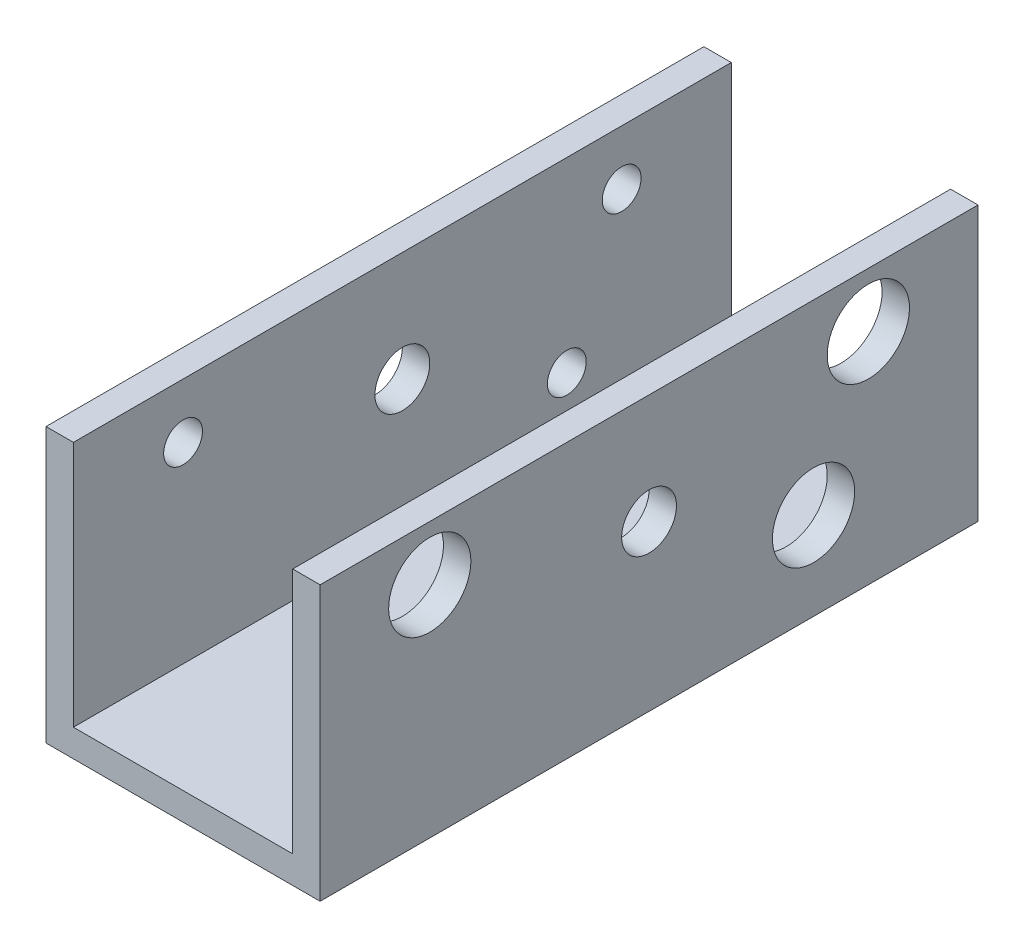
ISO-10303-21;
HEADER;
FILE_DESCRIPTION(('STEP AP214'),'2;1');
FILE_NAME('part.step','',(''),(''),'','','');
FILE_SCHEMA(('AUTOMOTIVE_DESIGN { 1 0 10303 214 1 1 1 1 }'));
ENDSEC;
DATA;
#1=APPLICATION_CONTEXT('core data for automotive mechanical design processes');
#2=APPLICATION_PROTOCOL_DEFINITION('international standard','automotive_design',2000,#1);
#3=PRODUCT_CONTEXT('',#1,'mechanical');
#4=PRODUCT('Part','Part','',(#3));
#5=PRODUCT_RELATED_PRODUCT_CATEGORY('part','',(#4));
#6=PRODUCT_DEFINITION_FORMATION('','',#4);
#7=PRODUCT_DEFINITION_CONTEXT('part definition',#1,'design');
#8=PRODUCT_DEFINITION('design','',#6,#7);
#9=PRODUCT_DEFINITION_SHAPE('','',#8);
#10=(LENGTH_UNIT() NAMED_UNIT(*) SI_UNIT(.MILLI.,.METRE.));
#11=(NAMED_UNIT(*) PLANE_ANGLE_UNIT() SI_UNIT($,.RADIAN.));
#12=(NAMED_UNIT(*) SI_UNIT($,.STERADIAN.) SOLID_ANGLE_UNIT());
#13=UNCERTAINTY_MEASURE_WITH_UNIT(LENGTH_MEASURE(1.E-05),#10,'distance_accuracy_value','');
#14=(GEOMETRIC_REPRESENTATION_CONTEXT(3) GLOBAL_UNCERTAINTY_ASSIGNED_CONTEXT((#13)) GLOBAL_UNIT_ASSIGNED_CONTEXT((#10,
#11,#12)) REPRESENTATION_CONTEXT('',''));
#15=CARTESIAN_POINT('',(0.,0.,0.));
#16=DIRECTION('',(0.,0.,1.));
#17=DIRECTION('',(1.,0.,0.));
#18=AXIS2_PLACEMENT_3D('',#15,#16,#17);
#19=CARTESIAN_POINT('',(31.75,0.,76.2));
#20=DIRECTION('',(0.,1.,0.));
#21=DIRECTION('',(-1.,0.,0.));
#22=AXIS2_PLACEMENT_3D('',#19,#20,#21);
#23=PLANE('',#22);
#24=DIRECTION('',(1.,0.,0.));
#25=VECTOR('',#24,1.);
#26=CARTESIAN_POINT('',(31.75,0.,0.));
#27=LINE('',#26,#25);
#28=CARTESIAN_POINT('',(0.,0.,0.));
#29=VERTEX_POINT('',#28);
#30=CARTESIAN_POINT('',(31.75,0.,0.));
#31=VERTEX_POINT('',#30);
#32=EDGE_CURVE('E129',#29,#31,#27,.T.);
#33=ORIENTED_EDGE('',*,*,#32,.T.);
#34=DIRECTION('',(0.,0.,-1.));
#35=VECTOR('',#34,1.);
#36=CARTESIAN_POINT('',(31.75,0.,76.2));
#37=LINE('',#36,#35);
#38=CARTESIAN_POINT('',(31.75,0.,76.2));
#39=VERTEX_POINT('',#38);
#40=EDGE_CURVE('E11',#39,#31,#37,.T.);
#41=ORIENTED_EDGE('',*,*,#40,.F.);
#42=DIRECTION('',(1.,0.,0.));
#43=VECTOR('',#42,1.);
#44=CARTESIAN_POINT('',(31.75,0.,76.2));
#45=LINE('',#44,#43);
#46=CARTESIAN_POINT('',(0.,0.,76.2));
#47=VERTEX_POINT('',#46);
#48=EDGE_CURVE('E144',#47,#39,#45,.T.);
#49=ORIENTED_EDGE('',*,*,#48,.F.);
#50=DIRECTION('',(0.,0.,-1.));
#51=VECTOR('',#50,1.);
#52=CARTESIAN_POINT('',(0.,0.,76.2));
#53=LINE('',#52,#51);
#54=EDGE_CURVE('E125',#47,#29,#53,.T.);
#55=ORIENTED_EDGE('',*,*,#54,.T.);
#56=EDGE_LOOP('',(#33,#41,#49,#55));
#57=FACE_BOUND('',#56,.T.);
#58=ADVANCED_FACE('F32',(#57),#23,.F.);
#59=CARTESIAN_POINT('',(31.75,31.75,76.2));
#60=DIRECTION('',(-1.,0.,0.));
#61=DIRECTION('',(0.,-1.,0.));
#62=AXIS2_PLACEMENT_3D('',#59,#60,#61);
#63=PLANE('',#62);
#64=CARTESIAN_POINT('',(31.75,10.16,19.05));
#65=DIRECTION('',(1.,0.,0.));
#66=DIRECTION('',(0.,1.,0.));
#67=AXIS2_PLACEMENT_3D('',#64,#65,#66);
#68=CIRCLE('',#67,4.7625);
#69=CARTESIAN_POINT('',(31.75,14.9225,19.05));
#70=VERTEX_POINT('',#69);
#71=EDGE_CURVE('E196',#70,#70,#68,.T.);
#72=ORIENTED_EDGE('',*,*,#71,.F.);
#73=EDGE_LOOP('',(#72));
#74=FACE_BOUND('',#73,.T.);
#75=CARTESIAN_POINT('',(31.75,25.4,12.7));
#76=DIRECTION('',(1.,0.,0.));
#77=DIRECTION('',(0.,1.,0.));
#78=AXIS2_PLACEMENT_3D('',#75,#76,#77);
#79=CIRCLE('',#78,4.7625);
#80=CARTESIAN_POINT('',(31.75,30.1625,12.7));
#81=VERTEX_POINT('',#80);
#82=EDGE_CURVE('E190',#81,#81,#79,.T.);
#83=ORIENTED_EDGE('',*,*,#82,.F.);
#84=EDGE_LOOP('',(#83));
#85=FACE_BOUND('',#84,.T.);
#86=CARTESIAN_POINT('',(31.75,25.4,63.5));
#87=DIRECTION('',(1.,0.,0.));
#88=DIRECTION('',(0.,1.,0.));
#89=AXIS2_PLACEMENT_3D('',#86,#87,#88);
#90=CIRCLE('',#89,4.7625);
#91=CARTESIAN_POINT('',(31.75,30.1625,63.5));
#92=VERTEX_POINT('',#91);
#93=EDGE_CURVE('E184',#92,#92,#90,.T.);
#94=ORIENTED_EDGE('',*,*,#93,.F.);
#95=EDGE_LOOP('',(#94));
#96=FACE_BOUND('',#95,.T.);
#97=CARTESIAN_POINT('',(31.75,19.05,38.1));
#98=DIRECTION('',(1.,0.,0.));
#99=DIRECTION('',(0.,1.,0.));
#100=AXIS2_PLACEMENT_3D('',#97,#98,#99);
#101=CIRCLE('',#100,3.175);
#102=CARTESIAN_POINT('',(31.75,22.225,38.1));
#103=VERTEX_POINT('',#102);
#104=EDGE_CURVE('E178',#103,#103,#101,.T.);
#105=ORIENTED_EDGE('',*,*,#104,.F.);
#106=EDGE_LOOP('',(#105));
#107=FACE_BOUND('',#106,.T.);
#108=DIRECTION('',(0.,1.,0.));
#109=VECTOR('',#108,1.);
#110=CARTESIAN_POINT('',(31.75,31.75,0.));
#111=LINE('',#110,#109);
#112=CARTESIAN_POINT('',(31.75,31.75,0.));
#113=VERTEX_POINT('',#112);
#114=EDGE_CURVE('E132',#31,#113,#111,.T.);
#115=ORIENTED_EDGE('',*,*,#114,.T.);
#116=DIRECTION('',(0.,0.,-1.));
#117=VECTOR('',#116,1.);
#118=CARTESIAN_POINT('',(31.75,31.75,76.2));
#119=LINE('',#118,#117);
#120=CARTESIAN_POINT('',(31.75,31.75,76.2));
#121=VERTEX_POINT('',#120);
#122=EDGE_CURVE('E41',#121,#113,#119,.T.);
#123=ORIENTED_EDGE('',*,*,#122,.F.);
#124=DIRECTION('',(0.,1.,0.));
#125=VECTOR('',#124,1.);
#126=CARTESIAN_POINT('',(31.75,31.75,76.2));
#127=LINE('',#126,#125);
#128=EDGE_CURVE('E92',#39,#121,#127,.T.);
#129=ORIENTED_EDGE('',*,*,#128,.F.);
#130=ORIENTED_EDGE('',*,*,#40,.T.);
#131=EDGE_LOOP('',(#115,#123,#129,#130));
#132=FACE_BOUND('',#131,.T.);
#133=ADVANCED_FACE('F253',(#74,#85,#96,#107,#132),#63,.F.);
#134=CARTESIAN_POINT('',(28.575,31.75,76.2));
#135=DIRECTION('',(0.,-1.,0.));
#136=DIRECTION('',(0.,0.,-1.));
#137=AXIS2_PLACEMENT_3D('',#134,#135,#136);
#138=PLANE('',#137);
#139=DIRECTION('',(-1.,0.,0.));
#140=VECTOR('',#139,1.);
#141=CARTESIAN_POINT('',(28.575,31.75,0.));
#142=LINE('',#141,#140);
#143=CARTESIAN_POINT('',(28.575,31.75,0.));
#144=VERTEX_POINT('',#143);
#145=EDGE_CURVE('E135',#113,#144,#142,.T.);
#146=ORIENTED_EDGE('',*,*,#145,.T.);
#147=DIRECTION('',(0.,0.,-1.));
#148=VECTOR('',#147,1.);
#149=CARTESIAN_POINT('',(28.575,31.75,76.2));
#150=LINE('',#149,#148);
#151=CARTESIAN_POINT('',(28.575,31.75,76.2));
#152=VERTEX_POINT('',#151);
#153=EDGE_CURVE('E151',#152,#144,#150,.T.);
#154=ORIENTED_EDGE('',*,*,#153,.F.);
#155=DIRECTION('',(-1.,0.,0.));
#156=VECTOR('',#155,1.);
#157=CARTESIAN_POINT('',(28.575,31.75,76.2));
#158=LINE('',#157,#156);
#159=EDGE_CURVE('E160',#121,#152,#158,.T.);
#160=ORIENTED_EDGE('',*,*,#159,.F.);
#161=ORIENTED_EDGE('',*,*,#122,.T.);
#162=EDGE_LOOP('',(#146,#154,#160,#161));
#163=FACE_BOUND('',#162,.T.);
#164=ADVANCED_FACE('F158',(#163),#138,.F.);
#165=CARTESIAN_POINT('',(28.575,3.175,76.2));
#166=DIRECTION('',(1.,0.,0.));
#167=DIRECTION('',(0.,0.,-1.));
#168=AXIS2_PLACEMENT_3D('',#165,#166,#167);
#169=PLANE('',#168);
#170=CARTESIAN_POINT('',(28.575,10.16,19.05));
#171=DIRECTION('',(1.,0.,0.));
#172=DIRECTION('',(0.,0.,-1.));
#173=AXIS2_PLACEMENT_3D('',#170,#171,#172);
#174=CIRCLE('',#173,4.7625);
#175=CARTESIAN_POINT('',(28.575,10.16,14.2875));
#176=VERTEX_POINT('',#175);
#177=EDGE_CURVE('E193',#176,#176,#174,.F.);
#178=ORIENTED_EDGE('',*,*,#177,.F.);
#179=EDGE_LOOP('',(#178));
#180=FACE_BOUND('',#179,.T.);
#181=CARTESIAN_POINT('',(28.575,25.4,12.7));
#182=DIRECTION('',(1.,0.,0.));
#183=DIRECTION('',(0.,0.,-1.));
#184=AXIS2_PLACEMENT_3D('',#181,#182,#183);
#185=CIRCLE('',#184,4.7625);
#186=CARTESIAN_POINT('',(28.575,25.4,7.9375));
#187=VERTEX_POINT('',#186);
#188=EDGE_CURVE('E187',#187,#187,#185,.F.);
#189=ORIENTED_EDGE('',*,*,#188,.F.);
#190=EDGE_LOOP('',(#189));
#191=FACE_BOUND('',#190,.T.);
#192=CARTESIAN_POINT('',(28.575,25.4,63.5));
#193=DIRECTION('',(1.,0.,0.));
#194=DIRECTION('',(0.,0.,-1.));
#195=AXIS2_PLACEMENT_3D('',#192,#193,#194);
#196=CIRCLE('',#195,4.7625);
#197=CARTESIAN_POINT('',(28.575,25.4,58.7375));
#198=VERTEX_POINT('',#197);
#199=EDGE_CURVE('E181',#198,#198,#196,.F.);
#200=ORIENTED_EDGE('',*,*,#199,.F.);
#201=EDGE_LOOP('',(#200));
#202=FACE_BOUND('',#201,.T.);
#203=CARTESIAN_POINT('',(28.575,19.05,38.1));
#204=DIRECTION('',(1.,0.,0.));
#205=DIRECTION('',(0.,0.,-1.));
#206=AXIS2_PLACEMENT_3D('',#203,#204,#205);
#207=CIRCLE('',#206,3.175);
#208=CARTESIAN_POINT('',(28.575,19.05,34.925));
#209=VERTEX_POINT('',#208);
#210=EDGE_CURVE('E133',#209,#209,#207,.F.);
#211=ORIENTED_EDGE('',*,*,#210,.F.);
#212=EDGE_LOOP('',(#211));
#213=FACE_BOUND('',#212,.T.);
#214=DIRECTION('',(0.,-1.,0.));
#215=VECTOR('',#214,1.);
#216=CARTESIAN_POINT('',(28.575,3.175,0.));
#217=LINE('',#216,#215);
#218=CARTESIAN_POINT('',(28.575,3.175,0.));
#219=VERTEX_POINT('',#218);
#220=EDGE_CURVE('E137',#144,#219,#217,.T.);
#221=ORIENTED_EDGE('',*,*,#220,.T.);
#222=DIRECTION('',(0.,0.,-1.));
#223=VECTOR('',#222,1.);
#224=CARTESIAN_POINT('',(28.575,3.175,76.2));
#225=LINE('',#224,#223);
#226=CARTESIAN_POINT('',(28.575,3.175,76.2));
#227=VERTEX_POINT('',#226);
#228=EDGE_CURVE('E148',#227,#219,#225,.T.);
#229=ORIENTED_EDGE('',*,*,#228,.F.);
#230=DIRECTION('',(0.,-1.,0.));
#231=VECTOR('',#230,1.);
#232=CARTESIAN_POINT('',(28.575,3.175,76.2));
#233=LINE('',#232,#231);
#234=EDGE_CURVE('E172',#152,#227,#233,.T.);
#235=ORIENTED_EDGE('',*,*,#234,.F.);
#236=ORIENTED_EDGE('',*,*,#153,.T.);
#237=EDGE_LOOP('',(#221,#229,#235,#236));
#238=FACE_BOUND('',#237,.T.);
#239=ADVANCED_FACE('F168',(#180,#191,#202,#213,#238),#169,.F.);
#240=CARTESIAN_POINT('',(3.175,3.17499999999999,76.2));
#241=DIRECTION('',(0.,-1.,0.));
#242=DIRECTION('',(1.,0.,0.));
#243=AXIS2_PLACEMENT_3D('',#240,#241,#242);
#244=PLANE('',#243);
#245=DIRECTION('',(-1.,0.,0.));
#246=VECTOR('',#245,1.);
#247=CARTESIAN_POINT('',(3.175,3.17499999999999,0.));
#248=LINE('',#247,#246);
#249=CARTESIAN_POINT('',(3.175,3.17499999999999,0.));
#250=VERTEX_POINT('',#249);
#251=EDGE_CURVE('E139',#219,#250,#248,.T.);
#252=ORIENTED_EDGE('',*,*,#251,.T.);
#253=DIRECTION('',(0.,0.,-1.));
#254=VECTOR('',#253,1.);
#255=CARTESIAN_POINT('',(3.175,3.17499999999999,76.2));
#256=LINE('',#255,#254);
#257=CARTESIAN_POINT('',(3.175,3.17499999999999,76.2));
#258=VERTEX_POINT('',#257);
#259=EDGE_CURVE('E120',#258,#250,#256,.T.);
#260=ORIENTED_EDGE('',*,*,#259,.F.);
#261=DIRECTION('',(-1.,0.,0.));
#262=VECTOR('',#261,1.);
#263=CARTESIAN_POINT('',(3.175,3.17499999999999,76.2));
#264=LINE('',#263,#262);
#265=EDGE_CURVE('E111',#227,#258,#264,.T.);
#266=ORIENTED_EDGE('',*,*,#265,.F.);
#267=ORIENTED_EDGE('',*,*,#228,.T.);
#268=EDGE_LOOP('',(#252,#260,#266,#267));
#269=FACE_BOUND('',#268,.T.);
#270=ADVANCED_FACE('F171',(#269),#244,.F.);
#271=CARTESIAN_POINT('',(3.175,31.75,76.2));
#272=DIRECTION('',(-1.,0.,0.));
#273=DIRECTION('',(0.,-1.,0.));
#274=AXIS2_PLACEMENT_3D('',#271,#272,#273);
#275=PLANE('',#274);
#276=CARTESIAN_POINT('',(3.175,25.4,12.7));
#277=DIRECTION('',(1.,0.,0.));
#278=DIRECTION('',(0.,0.,-1.));
#279=AXIS2_PLACEMENT_3D('',#276,#277,#278);
#280=CIRCLE('',#279,2.2479);
#281=CARTESIAN_POINT('',(3.175,25.4,10.4521));
#282=VERTEX_POINT('',#281);
#283=EDGE_CURVE('E219',#282,#282,#280,.T.);
#284=ORIENTED_EDGE('',*,*,#283,.F.);
#285=EDGE_LOOP('',(#284));
#286=FACE_BOUND('',#285,.T.);
#287=CARTESIAN_POINT('',(3.175,10.16,19.05));
#288=DIRECTION('',(1.,0.,0.));
#289=DIRECTION('',(0.,0.,-1.));
#290=AXIS2_PLACEMENT_3D('',#287,#288,#289);
#291=CIRCLE('',#290,2.2479);
#292=CARTESIAN_POINT('',(3.175,10.16,16.8021));
#293=VERTEX_POINT('',#292);
#294=EDGE_CURVE('E213',#293,#293,#291,.T.);
#295=ORIENTED_EDGE('',*,*,#294,.F.);
#296=EDGE_LOOP('',(#295));
#297=FACE_BOUND('',#296,.T.);
#298=CARTESIAN_POINT('',(3.175,25.4,63.5));
#299=DIRECTION('',(1.,0.,0.));
#300=DIRECTION('',(0.,0.,-1.));
#301=AXIS2_PLACEMENT_3D('',#298,#299,#300);
#302=CIRCLE('',#301,2.2479);
#303=CARTESIAN_POINT('',(3.175,25.4,61.2521));
#304=VERTEX_POINT('',#303);
#305=EDGE_CURVE('E210',#304,#304,#302,.T.);
#306=ORIENTED_EDGE('',*,*,#305,.F.);
#307=EDGE_LOOP('',(#306));
#308=FACE_BOUND('',#307,.T.);
#309=CARTESIAN_POINT('',(3.175,19.05,38.1));
#310=DIRECTION('',(1.,0.,0.));
#311=DIRECTION('',(0.,1.,0.));
#312=AXIS2_PLACEMENT_3D('',#309,#310,#311);
#313=CIRCLE('',#312,3.175);
#314=CARTESIAN_POINT('',(3.175,22.225,38.1));
#315=VERTEX_POINT('',#314);
#316=EDGE_CURVE('E202',#315,#315,#313,.T.);
#317=ORIENTED_EDGE('',*,*,#316,.F.);
#318=EDGE_LOOP('',(#317));
#319=FACE_BOUND('',#318,.T.);
#320=DIRECTION('',(0.,1.,0.));
#321=VECTOR('',#320,1.);
#322=CARTESIAN_POINT('',(3.175,31.75,0.));
#323=LINE('',#322,#321);
#324=CARTESIAN_POINT('',(3.175,31.75,0.));
#325=VERTEX_POINT('',#324);
#326=EDGE_CURVE('E119',#250,#325,#323,.T.);
#327=ORIENTED_EDGE('',*,*,#326,.T.);
#328=DIRECTION('',(0.,0.,-1.));
#329=VECTOR('',#328,1.);
#330=CARTESIAN_POINT('',(3.175,31.75,76.2));
#331=LINE('',#330,#329);
#332=CARTESIAN_POINT('',(3.175,31.75,76.2));
#333=VERTEX_POINT('',#332);
#334=EDGE_CURVE('E116',#333,#325,#331,.T.);
#335=ORIENTED_EDGE('',*,*,#334,.F.);
#336=DIRECTION('',(0.,1.,0.));
#337=VECTOR('',#336,1.);
#338=CARTESIAN_POINT('',(3.175,31.75,76.2));
#339=LINE('',#338,#337);
#340=EDGE_CURVE('E105',#258,#333,#339,.T.);
#341=ORIENTED_EDGE('',*,*,#340,.F.);
#342=ORIENTED_EDGE('',*,*,#259,.T.);
#343=EDGE_LOOP('',(#327,#335,#341,#342));
#344=FACE_BOUND('',#343,.T.);
#345=ADVANCED_FACE('F117',(#286,#297,#308,#319,#344),#275,.F.);
#346=CARTESIAN_POINT('',(0.,31.75,76.2));
#347=DIRECTION('',(0.,-1.,0.));
#348=DIRECTION('',(0.,0.,-1.));
#349=AXIS2_PLACEMENT_3D('',#346,#347,#348);
#350=PLANE('',#349);
#351=DIRECTION('',(-1.,0.,0.));
#352=VECTOR('',#351,1.);
#353=CARTESIAN_POINT('',(0.,31.75,0.));
#354=LINE('',#353,#352);
#355=CARTESIAN_POINT('',(0.,31.75,0.));
#356=VERTEX_POINT('',#355);
#357=EDGE_CURVE('E78',#325,#356,#354,.T.);
#358=ORIENTED_EDGE('',*,*,#357,.T.);
#359=DIRECTION('',(0.,0.,-1.));
#360=VECTOR('',#359,1.);
#361=CARTESIAN_POINT('',(0.,31.75,76.2));
#362=LINE('',#361,#360);
#363=CARTESIAN_POINT('',(0.,31.75,76.2));
#364=VERTEX_POINT('',#363);
#365=EDGE_CURVE('E121',#364,#356,#362,.T.);
#366=ORIENTED_EDGE('',*,*,#365,.F.);
#367=DIRECTION('',(-1.,0.,0.));
#368=VECTOR('',#367,1.);
#369=CARTESIAN_POINT('',(0.,31.75,76.2));
#370=LINE('',#369,#368);
#371=EDGE_CURVE('E109',#333,#364,#370,.T.);
#372=ORIENTED_EDGE('',*,*,#371,.F.);
#373=ORIENTED_EDGE('',*,*,#334,.T.);
#374=EDGE_LOOP('',(#358,#366,#372,#373));
#375=FACE_BOUND('',#374,.T.);
#376=ADVANCED_FACE('F123',(#375),#350,.F.);
#377=CARTESIAN_POINT('',(0.,0.,76.2));
#378=DIRECTION('',(1.,0.,0.));
#379=DIRECTION('',(0.,0.,-1.));
#380=AXIS2_PLACEMENT_3D('',#377,#378,#379);
#381=PLANE('',#380);
#382=CARTESIAN_POINT('',(0.,25.4,12.7));
#383=DIRECTION('',(1.,0.,0.));
#384=DIRECTION('',(0.,0.,-1.));
#385=AXIS2_PLACEMENT_3D('',#382,#383,#384);
#386=CIRCLE('',#385,2.24789999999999);
#387=CARTESIAN_POINT('',(0.,25.4,10.4521));
#388=VERTEX_POINT('',#387);
#389=EDGE_CURVE('E216',#388,#388,#386,.T.);
#390=ORIENTED_EDGE('',*,*,#389,.T.);
#391=EDGE_LOOP('',(#390));
#392=FACE_BOUND('',#391,.T.);
#393=CARTESIAN_POINT('',(0.,10.16,19.05));
#394=DIRECTION('',(1.,0.,0.));
#395=DIRECTION('',(0.,0.,-1.));
#396=AXIS2_PLACEMENT_3D('',#393,#394,#395);
#397=CIRCLE('',#396,2.24789999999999);
#398=CARTESIAN_POINT('',(0.,10.16,16.8021));
#399=VERTEX_POINT('',#398);
#400=EDGE_CURVE('E35',#399,#399,#397,.T.);
#401=ORIENTED_EDGE('',*,*,#400,.T.);
#402=EDGE_LOOP('',(#401));
#403=FACE_BOUND('',#402,.T.);
#404=CARTESIAN_POINT('',(0.,25.4,63.5));
#405=DIRECTION('',(1.,0.,0.));
#406=DIRECTION('',(0.,0.,-1.));
#407=AXIS2_PLACEMENT_3D('',#404,#405,#406);
#408=CIRCLE('',#407,2.24789999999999);
#409=CARTESIAN_POINT('',(0.,25.4,61.2521));
#410=VERTEX_POINT('',#409);
#411=EDGE_CURVE('E205',#410,#410,#408,.T.);
#412=ORIENTED_EDGE('',*,*,#411,.T.);
#413=EDGE_LOOP('',(#412));
#414=FACE_BOUND('',#413,.T.);
#415=CARTESIAN_POINT('',(0.,19.05,38.1));
#416=DIRECTION('',(1.,0.,0.));
#417=DIRECTION('',(0.,1.,0.));
#418=AXIS2_PLACEMENT_3D('',#415,#416,#417);
#419=CIRCLE('',#418,3.175);
#420=CARTESIAN_POINT('',(0.,22.225,38.1));
#421=VERTEX_POINT('',#420);
#422=EDGE_CURVE('E199',#421,#421,#419,.T.);
#423=ORIENTED_EDGE('',*,*,#422,.T.);
#424=EDGE_LOOP('',(#423));
#425=FACE_BOUND('',#424,.T.);
#426=DIRECTION('',(0.,-1.,0.));
#427=VECTOR('',#426,1.);
#428=CARTESIAN_POINT('',(0.,0.,0.));
#429=LINE('',#428,#427);
#430=EDGE_CURVE('E84',#356,#29,#429,.T.);
#431=ORIENTED_EDGE('',*,*,#430,.T.);
#432=ORIENTED_EDGE('',*,*,#54,.F.);
#433=DIRECTION('',(0.,-1.,0.));
#434=VECTOR('',#433,1.);
#435=CARTESIAN_POINT('',(0.,0.,76.2));
#436=LINE('',#435,#434);
#437=EDGE_CURVE('E49',#364,#47,#436,.T.);
#438=ORIENTED_EDGE('',*,*,#437,.F.);
#439=ORIENTED_EDGE('',*,*,#365,.T.);
#440=EDGE_LOOP('',(#431,#432,#438,#439));
#441=FACE_BOUND('',#440,.T.);
#442=ADVANCED_FACE('F261',(#392,#403,#414,#425,#441),#381,.F.);
#443=CARTESIAN_POINT('',(0.,0.,76.2));
#444=DIRECTION('',(0.,0.,-1.));
#445=DIRECTION('',(-1.,0.,0.));
#446=AXIS2_PLACEMENT_3D('',#443,#444,#445);
#447=PLANE('',#446);
#448=ORIENTED_EDGE('',*,*,#48,.T.);
#449=ORIENTED_EDGE('',*,*,#128,.T.);
#450=ORIENTED_EDGE('',*,*,#159,.T.);
#451=ORIENTED_EDGE('',*,*,#234,.T.);
#452=ORIENTED_EDGE('',*,*,#265,.T.);
#453=ORIENTED_EDGE('',*,*,#340,.T.);
#454=ORIENTED_EDGE('',*,*,#371,.T.);
#455=ORIENTED_EDGE('',*,*,#437,.T.);
#456=EDGE_LOOP('',(#448,#449,#450,#451,#452,#453,#454,#455));
#457=FACE_BOUND('',#456,.T.);
#458=ADVANCED_FACE('F107',(#457),#447,.F.);
#459=CARTESIAN_POINT('',(0.,0.,0.));
#460=DIRECTION('',(0.,0.,-1.));
#461=DIRECTION('',(-1.,0.,0.));
#462=AXIS2_PLACEMENT_3D('',#459,#460,#461);
#463=PLANE('',#462);
#464=ORIENTED_EDGE('',*,*,#32,.F.);
#465=ORIENTED_EDGE('',*,*,#430,.F.);
#466=ORIENTED_EDGE('',*,*,#357,.F.);
#467=ORIENTED_EDGE('',*,*,#326,.F.);
#468=ORIENTED_EDGE('',*,*,#251,.F.);
#469=ORIENTED_EDGE('',*,*,#220,.F.);
#470=ORIENTED_EDGE('',*,*,#145,.F.);
#471=ORIENTED_EDGE('',*,*,#114,.F.);
#472=EDGE_LOOP('',(#464,#465,#466,#467,#468,#469,#470,#471));
#473=FACE_BOUND('',#472,.T.);
#474=ADVANCED_FACE('F164',(#473),#463,.T.);
#475=CARTESIAN_POINT('',(-0.00100000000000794,19.05,38.1));
#476=DIRECTION('',(1.,0.,0.));
#477=DIRECTION('',(0.,1.,0.));
#478=AXIS2_PLACEMENT_3D('',#475,#476,#477);
#479=CYLINDRICAL_SURFACE('',#478,3.175);
#480=ORIENTED_EDGE('',*,*,#104,.T.);
#481=EDGE_LOOP('',(#480));
#482=FACE_BOUND('',#481,.T.);
#483=ORIENTED_EDGE('',*,*,#210,.T.);
#484=EDGE_LOOP('',(#483));
#485=FACE_BOUND('',#484,.T.);
#486=ADVANCED_FACE('F316',(#482,#485),#479,.F.);
#487=CARTESIAN_POINT('',(-0.00100000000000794,25.4,63.5));
#488=DIRECTION('',(1.,0.,0.));
#489=DIRECTION('',(0.,1.,0.));
#490=AXIS2_PLACEMENT_3D('',#487,#488,#489);
#491=CYLINDRICAL_SURFACE('',#490,4.7625);
#492=ORIENTED_EDGE('',*,*,#93,.T.);
#493=EDGE_LOOP('',(#492));
#494=FACE_BOUND('',#493,.T.);
#495=ORIENTED_EDGE('',*,*,#199,.T.);
#496=EDGE_LOOP('',(#495));
#497=FACE_BOUND('',#496,.T.);
#498=ADVANCED_FACE('F340',(#494,#497),#491,.F.);
#499=CARTESIAN_POINT('',(-0.00100000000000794,25.4,12.7));
#500=DIRECTION('',(1.,0.,0.));
#501=DIRECTION('',(0.,1.,0.));
#502=AXIS2_PLACEMENT_3D('',#499,#500,#501);
#503=CYLINDRICAL_SURFACE('',#502,4.7625);
#504=ORIENTED_EDGE('',*,*,#82,.T.);
#505=EDGE_LOOP('',(#504));
#506=FACE_BOUND('',#505,.T.);
#507=ORIENTED_EDGE('',*,*,#188,.T.);
#508=EDGE_LOOP('',(#507));
#509=FACE_BOUND('',#508,.T.);
#510=ADVANCED_FACE('F248',(#506,#509),#503,.F.);
#511=CARTESIAN_POINT('',(-0.001000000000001,10.16,19.05));
#512=DIRECTION('',(1.,0.,0.));
#513=DIRECTION('',(0.,1.,0.));
#514=AXIS2_PLACEMENT_3D('',#511,#512,#513);
#515=CYLINDRICAL_SURFACE('',#514,4.7625);
#516=ORIENTED_EDGE('',*,*,#71,.T.);
#517=EDGE_LOOP('',(#516));
#518=FACE_BOUND('',#517,.T.);
#519=ORIENTED_EDGE('',*,*,#177,.T.);
#520=EDGE_LOOP('',(#519));
#521=FACE_BOUND('',#520,.T.);
#522=ADVANCED_FACE('F238',(#518,#521),#515,.F.);
#523=CARTESIAN_POINT('',(0.,19.05,38.1));
#524=DIRECTION('',(1.,0.,0.));
#525=DIRECTION('',(0.,1.,0.));
#526=AXIS2_PLACEMENT_3D('',#523,#524,#525);
#527=CYLINDRICAL_SURFACE('',#526,3.175);
#528=CARTESIAN_POINT('',(0.,22.225,38.1));
#529=CARTESIAN_POINT('',(0.0330729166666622,22.225,38.1));
#530=CARTESIAN_POINT('',(0.0661458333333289,22.225,38.1));
#531=CARTESIAN_POINT('',(0.132291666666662,22.225,38.1));
#532=CARTESIAN_POINT('',(0.165364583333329,22.225,38.1));
#533=CARTESIAN_POINT('',(0.231510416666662,22.225,38.1));
#534=CARTESIAN_POINT('',(0.264583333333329,22.225,38.1));
#535=CARTESIAN_POINT('',(0.330729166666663,22.225,38.1));
#536=CARTESIAN_POINT('',(0.363802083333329,22.225,38.1));
#537=CARTESIAN_POINT('',(0.429947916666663,22.225,38.1));
#538=CARTESIAN_POINT('',(0.463020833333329,22.225,38.1));
#539=CARTESIAN_POINT('',(0.529166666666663,22.225,38.1));
#540=CARTESIAN_POINT('',(0.56223958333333,22.225,38.1));
#541=CARTESIAN_POINT('',(0.628385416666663,22.225,38.1));
#542=CARTESIAN_POINT('',(0.66145833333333,22.225,38.1));
#543=CARTESIAN_POINT('',(0.727604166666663,22.225,38.1));
#544=CARTESIAN_POINT('',(0.76067708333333,22.225,38.1));
#545=CARTESIAN_POINT('',(0.826822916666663,22.225,38.1));
#546=CARTESIAN_POINT('',(0.85989583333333,22.225,38.1));
#547=CARTESIAN_POINT('',(0.926041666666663,22.225,38.1));
#548=CARTESIAN_POINT('',(0.95911458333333,22.225,38.1));
#549=CARTESIAN_POINT('',(1.02526041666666,22.225,38.1));
#550=CARTESIAN_POINT('',(1.05833333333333,22.225,38.1));
#551=CARTESIAN_POINT('',(1.12447916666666,22.225,38.1));
#552=CARTESIAN_POINT('',(1.15755208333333,22.225,38.1));
#553=CARTESIAN_POINT('',(1.22369791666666,22.225,38.1));
#554=CARTESIAN_POINT('',(1.25677083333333,22.225,38.1));
#555=CARTESIAN_POINT('',(1.32291666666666,22.225,38.1));
#556=CARTESIAN_POINT('',(1.35598958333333,22.225,38.1));
#557=CARTESIAN_POINT('',(1.42213541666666,22.225,38.1));
#558=CARTESIAN_POINT('',(1.45520833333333,22.225,38.1));
#559=CARTESIAN_POINT('',(1.52135416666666,22.225,38.1));
#560=CARTESIAN_POINT('',(1.55442708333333,22.225,38.1));
#561=CARTESIAN_POINT('',(1.62057291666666,22.225,38.1));
#562=CARTESIAN_POINT('',(1.65364583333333,22.225,38.1));
#563=CARTESIAN_POINT('',(1.71979166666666,22.225,38.1));
#564=CARTESIAN_POINT('',(1.75286458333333,22.225,38.1));
#565=CARTESIAN_POINT('',(1.81901041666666,22.225,38.1));
#566=CARTESIAN_POINT('',(1.85208333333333,22.225,38.1));
#567=CARTESIAN_POINT('',(1.91822916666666,22.225,38.1));
#568=CARTESIAN_POINT('',(1.95130208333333,22.225,38.1));
#569=CARTESIAN_POINT('',(2.01744791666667,22.225,38.1));
#570=CARTESIAN_POINT('',(2.05052083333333,22.225,38.1));
#571=CARTESIAN_POINT('',(2.11666666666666,22.225,38.1));
#572=CARTESIAN_POINT('',(2.14973958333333,22.225,38.1));
#573=CARTESIAN_POINT('',(2.21588541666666,22.225,38.1));
#574=CARTESIAN_POINT('',(2.24895833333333,22.225,38.1));
#575=CARTESIAN_POINT('',(2.31510416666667,22.225,38.1));
#576=CARTESIAN_POINT('',(2.34817708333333,22.225,38.1));
#577=CARTESIAN_POINT('',(2.41432291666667,22.225,38.1));
#578=CARTESIAN_POINT('',(2.44739583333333,22.225,38.1));
#579=CARTESIAN_POINT('',(2.51354166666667,22.225,38.1));
#580=CARTESIAN_POINT('',(2.54661458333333,22.225,38.1));
#581=CARTESIAN_POINT('',(2.61276041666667,22.225,38.1));
#582=CARTESIAN_POINT('',(2.64583333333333,22.225,38.1));
#583=CARTESIAN_POINT('',(2.71197916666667,22.225,38.1));
#584=CARTESIAN_POINT('',(2.74505208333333,22.225,38.1));
#585=CARTESIAN_POINT('',(2.81119791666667,22.225,38.1));
#586=CARTESIAN_POINT('',(2.84427083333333,22.225,38.1));
#587=CARTESIAN_POINT('',(2.91041666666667,22.225,38.1));
#588=CARTESIAN_POINT('',(2.94348958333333,22.225,38.1));
#589=CARTESIAN_POINT('',(3.00963541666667,22.225,38.1));
#590=CARTESIAN_POINT('',(3.04270833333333,22.225,38.1));
#591=CARTESIAN_POINT('',(3.10885416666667,22.225,38.1));
#592=CARTESIAN_POINT('',(3.14192708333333,22.225,38.1));
#593=CARTESIAN_POINT('',(3.175,22.225,38.1));
#594=B_SPLINE_CURVE_WITH_KNOTS('',3,(#528,#529,#530,#531,#532,#533,#534,#535,#536,#537,#538,
#539,#540,#541,#542,#543,#544,#545,#546,#547,#548,#549,#550,#551,#552,#553,#554,#555,#556,#557,
#558,#559,#560,#561,#562,#563,#564,#565,#566,#567,#568,#569,#570,#571,#572,#573,#574,#575,#576,
#577,#578,#579,#580,#581,#582,#583,#584,#585,#586,#587,#588,#589,#590,#591,#592,#593),
.UNSPECIFIED.,.F.,.F.,(4,2,2,2,2,2,2,2,2,2,2,2,2,2,2,2,2,2,2,2,2,2,2,2,2,2,2,2,2,2,2,2,4),(0.,
0.0992187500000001,0.1984375,0.297656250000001,0.396875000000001,0.496093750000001,
0.595312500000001,0.694531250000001,0.793750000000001,0.892968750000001,0.992187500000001,
1.09140625,1.190625,1.28984375,1.3890625,1.48828125,1.5875,1.68671875,1.7859375,1.88515625,
1.984375,2.08359375,2.1828125,2.28203125,2.38125,2.48046875,2.5796875,2.67890625,2.778125,
2.87734375,2.9765625,3.07578125,3.175),.UNSPECIFIED.);
#595=EDGE_CURVE('BSEAM235',#421,#315,#594,.T.);
#596=ORIENTED_EDGE('',*,*,#422,.F.);
#597=ORIENTED_EDGE('',*,*,#316,.T.);
#598=ORIENTED_EDGE('',*,*,#595,.T.);
#599=ORIENTED_EDGE('',*,*,#595,.F.);
#600=EDGE_LOOP('',(#596,#598,#597,#599));
#601=FACE_BOUND('',#600,.T.);
#602=ADVANCED_FACE('F235',(#601),#527,.F.);
#603=CARTESIAN_POINT('',(3.175,25.4,63.5));
#604=DIRECTION('',(1.,0.,0.));
#605=DIRECTION('',(0.,0.,-1.));
#606=AXIS2_PLACEMENT_3D('',#603,#604,#605);
#607=CYLINDRICAL_SURFACE('',#606,2.24789999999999);
#608=ORIENTED_EDGE('',*,*,#305,.T.);
#609=EDGE_LOOP('',(#608));
#610=FACE_BOUND('',#609,.T.);
#611=ORIENTED_EDGE('',*,*,#411,.F.);
#612=EDGE_LOOP('',(#611));
#613=FACE_BOUND('',#612,.T.);
#614=ADVANCED_FACE('F237',(#610,#613),#607,.F.);
#615=CARTESIAN_POINT('',(3.175,10.16,19.05));
#616=DIRECTION('',(1.,0.,0.));
#617=DIRECTION('',(0.,0.,-1.));
#618=AXIS2_PLACEMENT_3D('',#615,#616,#617);
#619=CYLINDRICAL_SURFACE('',#618,2.24789999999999);
#620=ORIENTED_EDGE('',*,*,#294,.T.);
#621=EDGE_LOOP('',(#620));
#622=FACE_BOUND('',#621,.T.);
#623=ORIENTED_EDGE('',*,*,#400,.F.);
#624=EDGE_LOOP('',(#623));
#625=FACE_BOUND('',#624,.T.);
#626=ADVANCED_FACE('F245',(#622,#625),#619,.F.);
#627=CARTESIAN_POINT('',(3.175,25.4,12.7));
#628=DIRECTION('',(1.,0.,0.));
#629=DIRECTION('',(0.,0.,-1.));
#630=AXIS2_PLACEMENT_3D('',#627,#628,#629);
#631=CYLINDRICAL_SURFACE('',#630,2.24789999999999);
#632=ORIENTED_EDGE('',*,*,#283,.T.);
#633=EDGE_LOOP('',(#632));
#634=FACE_BOUND('',#633,.T.);
#635=ORIENTED_EDGE('',*,*,#389,.F.);
#636=EDGE_LOOP('',(#635));
#637=FACE_BOUND('',#636,.T.);
#638=ADVANCED_FACE('F223',(#634,#637),#631,.F.);
#639=CLOSED_SHELL('',(#58,#133,#164,#239,#270,#345,#376,#442,#458,#474,#486,#498,#510,#522,#602,
#614,#626,#638));
#640=MANIFOLD_SOLID_BREP('B2',#639);
#641=ADVANCED_BREP_SHAPE_REPRESENTATION('',(#18,#640),#14);
#642=SHAPE_DEFINITION_REPRESENTATION(#9,#641);
ENDSEC;
END-ISO-10303-21;
